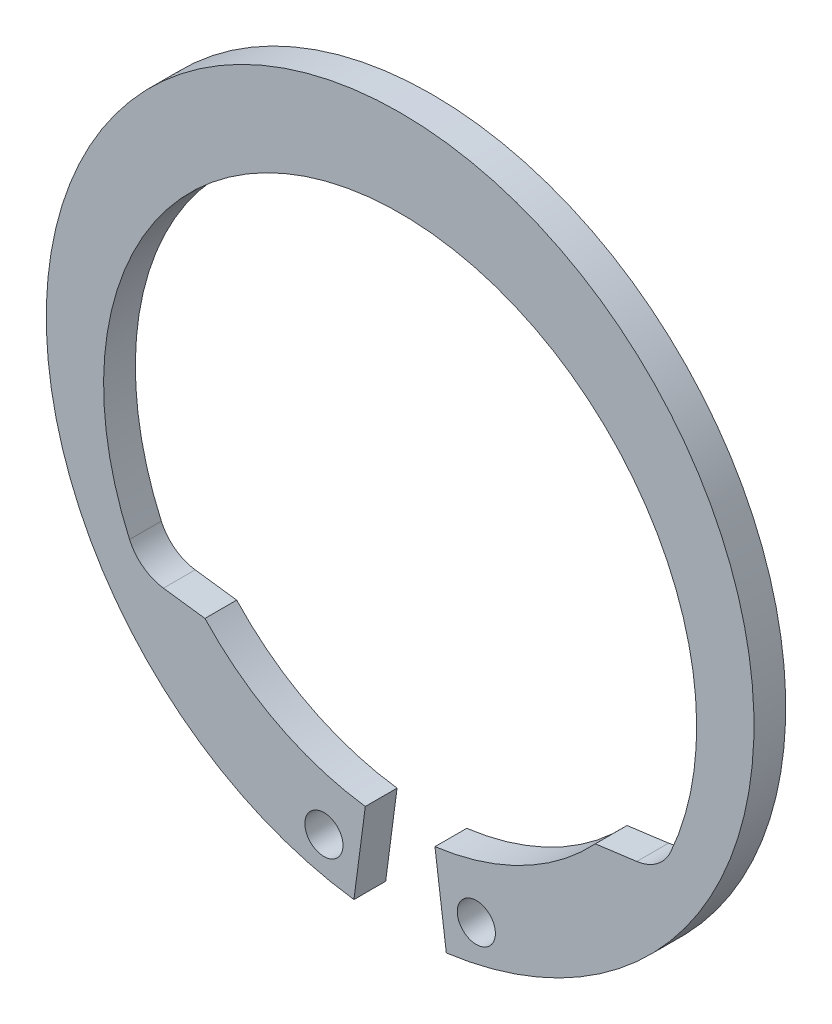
ISO-10303-21;
HEADER;
FILE_DESCRIPTION(('STEP AP214'),'2;1');
FILE_NAME('part.step','',(''),(''),'','','');
FILE_SCHEMA(('AUTOMOTIVE_DESIGN { 1 0 10303 214 1 1 1 1 }'));
ENDSEC;
DATA;
#1=APPLICATION_CONTEXT('core data for automotive mechanical design processes');
#2=APPLICATION_PROTOCOL_DEFINITION('international standard','automotive_design',2000,#1);
#3=PRODUCT_CONTEXT('',#1,'mechanical');
#4=PRODUCT('Part','Part','',(#3));
#5=PRODUCT_RELATED_PRODUCT_CATEGORY('part','',(#4));
#6=PRODUCT_DEFINITION_FORMATION('','',#4);
#7=PRODUCT_DEFINITION_CONTEXT('part definition',#1,'design');
#8=PRODUCT_DEFINITION('design','',#6,#7);
#9=PRODUCT_DEFINITION_SHAPE('','',#8);
#10=(LENGTH_UNIT() NAMED_UNIT(*) SI_UNIT(.MILLI.,.METRE.));
#11=(NAMED_UNIT(*) PLANE_ANGLE_UNIT() SI_UNIT($,.RADIAN.));
#12=(NAMED_UNIT(*) SI_UNIT($,.STERADIAN.) SOLID_ANGLE_UNIT());
#13=UNCERTAINTY_MEASURE_WITH_UNIT(LENGTH_MEASURE(1.E-05),#10,'distance_accuracy_value','');
#14=(GEOMETRIC_REPRESENTATION_CONTEXT(3) GLOBAL_UNCERTAINTY_ASSIGNED_CONTEXT((#13)) GLOBAL_UNIT_ASSIGNED_CONTEXT((#10,
#11,#12)) REPRESENTATION_CONTEXT('',''));
#15=CARTESIAN_POINT('',(0.,0.,0.));
#16=DIRECTION('',(0.,0.,1.));
#17=DIRECTION('',(1.,0.,0.));
#18=AXIS2_PLACEMENT_3D('',#15,#16,#17);
#19=CARTESIAN_POINT('',(0.,0.,-0.889));
#20=DIRECTION('',(0.,0.,1.));
#21=DIRECTION('',(1.,0.,0.));
#22=AXIS2_PLACEMENT_3D('',#19,#20,#21);
#23=CYLINDRICAL_SURFACE('',#22,9.906);
#24=CARTESIAN_POINT('',(0.,0.,0.));
#25=DIRECTION('',(0.,0.,1.));
#26=DIRECTION('',(1.,0.,0.));
#27=AXIS2_PLACEMENT_3D('',#24,#25,#26);
#28=CIRCLE('',#27,9.906);
#29=CARTESIAN_POINT('',(1.29299246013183,-9.82125279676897,0.));
#30=VERTEX_POINT('',#29);
#31=CARTESIAN_POINT('',(-1.29299246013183,-9.82125279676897,0.));
#32=VERTEX_POINT('',#31);
#33=EDGE_CURVE('E142',#30,#32,#28,.T.);
#34=ORIENTED_EDGE('',*,*,#33,.F.);
#35=DIRECTION('',(0.,0.,1.));
#36=VECTOR('',#35,1.);
#37=CARTESIAN_POINT('',(1.29299246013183,-9.82125279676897,-0.889));
#38=LINE('',#37,#36);
#39=CARTESIAN_POINT('',(1.29299246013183,-9.82125279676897,-0.889));
#40=VERTEX_POINT('',#39);
#41=EDGE_CURVE('E11',#40,#30,#38,.T.);
#42=ORIENTED_EDGE('',*,*,#41,.F.);
#43=CARTESIAN_POINT('',(0.,0.,-0.889));
#44=DIRECTION('',(0.,0.,1.));
#45=DIRECTION('',(1.,0.,0.));
#46=AXIS2_PLACEMENT_3D('',#43,#44,#45);
#47=CIRCLE('',#46,9.906);
#48=CARTESIAN_POINT('',(-1.29299246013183,-9.82125279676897,-0.889));
#49=VERTEX_POINT('',#48);
#50=EDGE_CURVE('E169',#40,#49,#47,.T.);
#51=ORIENTED_EDGE('',*,*,#50,.T.);
#52=DIRECTION('',(0.,0.,1.));
#53=VECTOR('',#52,1.);
#54=CARTESIAN_POINT('',(-1.29299246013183,-9.82125279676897,-0.889));
#55=LINE('',#54,#53);
#56=EDGE_CURVE('E36',#49,#32,#55,.T.);
#57=ORIENTED_EDGE('',*,*,#56,.T.);
#58=EDGE_LOOP('',(#34,#42,#51,#57));
#59=FACE_BOUND('',#58,.T.);
#60=ADVANCED_FACE('F33',(#59),#23,.T.);
#61=CARTESIAN_POINT('',(0.974717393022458,-7.40371364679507,-0.889));
#62=DIRECTION('',(-0.99144486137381,-0.130526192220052,0.));
#63=DIRECTION('',(0.130526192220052,-0.99144486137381,0.));
#64=AXIS2_PLACEMENT_3D('',#61,#62,#63);
#65=PLANE('',#64);
#66=DIRECTION('',(0.130526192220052,-0.99144486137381,0.));
#67=VECTOR('',#66,1.);
#68=CARTESIAN_POINT('',(0.974717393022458,-7.40371364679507,0.));
#69=LINE('',#68,#67);
#70=CARTESIAN_POINT('',(0.974717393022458,-7.40371364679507,0.));
#71=VERTEX_POINT('',#70);
#72=EDGE_CURVE('E167',#71,#30,#69,.T.);
#73=ORIENTED_EDGE('',*,*,#72,.F.);
#74=DIRECTION('',(0.,0.,1.));
#75=VECTOR('',#74,1.);
#76=CARTESIAN_POINT('',(0.974717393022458,-7.40371364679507,-0.889));
#77=LINE('',#76,#75);
#78=CARTESIAN_POINT('',(0.974717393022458,-7.40371364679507,-0.889));
#79=VERTEX_POINT('',#78);
#80=EDGE_CURVE('E42',#79,#71,#77,.T.);
#81=ORIENTED_EDGE('',*,*,#80,.F.);
#82=DIRECTION('',(0.130526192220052,-0.99144486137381,0.));
#83=VECTOR('',#82,1.);
#84=CARTESIAN_POINT('',(0.974717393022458,-7.40371364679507,-0.889));
#85=LINE('',#84,#83);
#86=EDGE_CURVE('E132',#79,#40,#85,.T.);
#87=ORIENTED_EDGE('',*,*,#86,.T.);
#88=ORIENTED_EDGE('',*,*,#41,.T.);
#89=EDGE_LOOP('',(#73,#81,#87,#88));
#90=FACE_BOUND('',#89,.T.);
#91=ADVANCED_FACE('F185',(#90),#65,.T.);
#92=CARTESIAN_POINT('',(0.,0.,-0.889));
#93=DIRECTION('',(0.,0.,1.));
#94=DIRECTION('',(1.,0.,0.));
#95=AXIS2_PLACEMENT_3D('',#92,#93,#94);
#96=CYLINDRICAL_SURFACE('',#95,7.4676);
#97=CARTESIAN_POINT('',(0.,0.,0.));
#98=DIRECTION('',(0.,0.,-1.));
#99=DIRECTION('',(1.,0.,0.));
#100=AXIS2_PLACEMENT_3D('',#97,#98,#99);
#101=CIRCLE('',#100,7.4676);
#102=CARTESIAN_POINT('',(5.46404070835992,-5.09011875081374,0.));
#103=VERTEX_POINT('',#102);
#104=EDGE_CURVE('E119',#103,#71,#101,.T.);
#105=ORIENTED_EDGE('',*,*,#104,.F.);
#106=DIRECTION('',(0.,0.,1.));
#107=VECTOR('',#106,1.);
#108=CARTESIAN_POINT('',(5.46404070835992,-5.09011875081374,-0.889));
#109=LINE('',#108,#107);
#110=CARTESIAN_POINT('',(5.46404070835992,-5.09011875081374,-0.889));
#111=VERTEX_POINT('',#110);
#112=EDGE_CURVE('E114',#111,#103,#109,.T.);
#113=ORIENTED_EDGE('',*,*,#112,.F.);
#114=CARTESIAN_POINT('',(0.,0.,-0.889));
#115=DIRECTION('',(0.,0.,-1.));
#116=DIRECTION('',(1.,0.,0.));
#117=AXIS2_PLACEMENT_3D('',#114,#115,#116);
#118=CIRCLE('',#117,7.4676);
#119=EDGE_CURVE('E117',#111,#79,#118,.T.);
#120=ORIENTED_EDGE('',*,*,#119,.T.);
#121=ORIENTED_EDGE('',*,*,#80,.T.);
#122=EDGE_LOOP('',(#105,#113,#120,#121));
#123=FACE_BOUND('',#122,.T.);
#124=ADVANCED_FACE('F116',(#123),#96,.F.);
#125=CARTESIAN_POINT('',(6.62556212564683,-4.93720155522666,-0.889));
#126=DIRECTION('',(-0.130526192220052,0.99144486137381,0.));
#127=DIRECTION('',(-0.99144486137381,-0.130526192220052,0.));
#128=AXIS2_PLACEMENT_3D('',#125,#126,#127);
#129=PLANE('',#128);
#130=DIRECTION('',(-0.99144486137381,-0.130526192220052,0.));
#131=VECTOR('',#130,1.);
#132=CARTESIAN_POINT('',(6.62556212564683,-4.93720155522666,0.));
#133=LINE('',#132,#131);
#134=CARTESIAN_POINT('',(6.62556212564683,-4.93720155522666,0.));
#135=VERTEX_POINT('',#134);
#136=EDGE_CURVE('E164',#135,#103,#133,.T.);
#137=ORIENTED_EDGE('',*,*,#136,.F.);
#138=DIRECTION('',(0.,0.,1.));
#139=VECTOR('',#138,1.);
#140=CARTESIAN_POINT('',(6.62556212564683,-4.93720155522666,-0.889));
#141=LINE('',#140,#139);
#142=CARTESIAN_POINT('',(6.62556212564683,-4.93720155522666,-0.889));
#143=VERTEX_POINT('',#142);
#144=EDGE_CURVE('E124',#143,#135,#141,.T.);
#145=ORIENTED_EDGE('',*,*,#144,.F.);
#146=DIRECTION('',(-0.99144486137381,-0.130526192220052,0.));
#147=VECTOR('',#146,1.);
#148=CARTESIAN_POINT('',(6.62556212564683,-4.93720155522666,-0.889));
#149=LINE('',#148,#147);
#150=EDGE_CURVE('E130',#143,#111,#149,.T.);
#151=ORIENTED_EDGE('',*,*,#150,.T.);
#152=ORIENTED_EDGE('',*,*,#112,.T.);
#153=EDGE_LOOP('',(#137,#145,#151,#152));
#154=FACE_BOUND('',#153,.T.);
#155=ADVANCED_FACE('F134',(#154),#129,.T.);
#156=CARTESIAN_POINT('',(6.46713130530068,-3.73379999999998,-0.889));
#157=DIRECTION('',(0.,0.,1.));
#158=DIRECTION('',(1.,0.,0.));
#159=AXIS2_PLACEMENT_3D('',#156,#157,#158);
#160=CYLINDRICAL_SURFACE('',#159,1.21378565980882);
#161=CARTESIAN_POINT('',(6.46713130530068,-3.73379999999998,0.));
#162=DIRECTION('',(0.,0.,-1.));
#163=DIRECTION('',(1.,0.,0.));
#164=AXIS2_PLACEMENT_3D('',#161,#162,#163);
#165=CIRCLE('',#164,1.21378565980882);
#166=CARTESIAN_POINT('',(7.57466030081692,-4.23044388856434,0.));
#167=VERTEX_POINT('',#166);
#168=EDGE_CURVE('E161',#167,#135,#165,.T.);
#169=ORIENTED_EDGE('',*,*,#168,.F.);
#170=DIRECTION('',(0.,0.,1.));
#171=VECTOR('',#170,1.);
#172=CARTESIAN_POINT('',(7.57466030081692,-4.23044388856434,-0.889));
#173=LINE('',#172,#171);
#174=CARTESIAN_POINT('',(7.57466030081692,-4.23044388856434,-0.889));
#175=VERTEX_POINT('',#174);
#176=EDGE_CURVE('E173',#175,#167,#173,.T.);
#177=ORIENTED_EDGE('',*,*,#176,.F.);
#178=CARTESIAN_POINT('',(6.46713130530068,-3.73379999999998,-0.889));
#179=DIRECTION('',(0.,0.,-1.));
#180=DIRECTION('',(1.,0.,0.));
#181=AXIS2_PLACEMENT_3D('',#178,#179,#180);
#182=CIRCLE('',#181,1.21378565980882);
#183=EDGE_CURVE('E135',#175,#143,#182,.T.);
#184=ORIENTED_EDGE('',*,*,#183,.T.);
#185=ORIENTED_EDGE('',*,*,#144,.T.);
#186=EDGE_LOOP('',(#169,#177,#184,#185));
#187=FACE_BOUND('',#186,.T.);
#188=ADVANCED_FACE('F198',(#187),#160,.F.);
#189=CARTESIAN_POINT('',(0.,-0.833775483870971,-0.889));
#190=DIRECTION('',(0.,0.,1.));
#191=DIRECTION('',(1.,0.,0.));
#192=AXIS2_PLACEMENT_3D('',#189,#190,#191);
#193=CYLINDRICAL_SURFACE('',#192,8.30137548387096);
#194=CARTESIAN_POINT('',(0.,-0.833775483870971,0.));
#195=DIRECTION('',(0.,0.,-1.));
#196=DIRECTION('',(1.,0.,0.));
#197=AXIS2_PLACEMENT_3D('',#194,#195,#196);
#198=CIRCLE('',#197,8.30137548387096);
#199=CARTESIAN_POINT('',(-7.57466030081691,-4.23044388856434,0.));
#200=VERTEX_POINT('',#199);
#201=EDGE_CURVE('E158',#200,#167,#198,.T.);
#202=ORIENTED_EDGE('',*,*,#201,.F.);
#203=DIRECTION('',(0.,0.,1.));
#204=VECTOR('',#203,1.);
#205=CARTESIAN_POINT('',(-7.57466030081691,-4.23044388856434,-0.889));
#206=LINE('',#205,#204);
#207=CARTESIAN_POINT('',(-7.57466030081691,-4.23044388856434,-0.889));
#208=VERTEX_POINT('',#207);
#209=EDGE_CURVE('E175',#208,#200,#206,.T.);
#210=ORIENTED_EDGE('',*,*,#209,.F.);
#211=CARTESIAN_POINT('',(0.,-0.833775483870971,-0.889));
#212=DIRECTION('',(0.,0.,-1.));
#213=DIRECTION('',(1.,0.,0.));
#214=AXIS2_PLACEMENT_3D('',#211,#212,#213);
#215=CIRCLE('',#214,8.30137548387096);
#216=EDGE_CURVE('E137',#208,#175,#215,.T.);
#217=ORIENTED_EDGE('',*,*,#216,.T.);
#218=ORIENTED_EDGE('',*,*,#176,.T.);
#219=EDGE_LOOP('',(#202,#210,#217,#218));
#220=FACE_BOUND('',#219,.T.);
#221=ADVANCED_FACE('F201',(#220),#193,.F.);
#222=CARTESIAN_POINT('',(-6.46713130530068,-3.73379999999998,-0.889));
#223=DIRECTION('',(0.,0.,1.));
#224=DIRECTION('',(1.,0.,0.));
#225=AXIS2_PLACEMENT_3D('',#222,#223,#224);
#226=CYLINDRICAL_SURFACE('',#225,1.21378565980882);
#227=CARTESIAN_POINT('',(-6.46713130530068,-3.73379999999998,0.));
#228=DIRECTION('',(0.,0.,-1.));
#229=DIRECTION('',(1.,0.,0.));
#230=AXIS2_PLACEMENT_3D('',#227,#228,#229);
#231=CIRCLE('',#230,1.21378565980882);
#232=CARTESIAN_POINT('',(-6.62556212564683,-4.93720155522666,0.));
#233=VERTEX_POINT('',#232);
#234=EDGE_CURVE('E155',#233,#200,#231,.T.);
#235=ORIENTED_EDGE('',*,*,#234,.F.);
#236=DIRECTION('',(0.,0.,1.));
#237=VECTOR('',#236,1.);
#238=CARTESIAN_POINT('',(-6.62556212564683,-4.93720155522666,-0.889));
#239=LINE('',#238,#237);
#240=CARTESIAN_POINT('',(-6.62556212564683,-4.93720155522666,-0.889));
#241=VERTEX_POINT('',#240);
#242=EDGE_CURVE('E177',#241,#233,#239,.T.);
#243=ORIENTED_EDGE('',*,*,#242,.F.);
#244=CARTESIAN_POINT('',(-6.46713130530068,-3.73379999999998,-0.889));
#245=DIRECTION('',(0.,0.,-1.));
#246=DIRECTION('',(1.,0.,0.));
#247=AXIS2_PLACEMENT_3D('',#244,#245,#246);
#248=CIRCLE('',#247,1.21378565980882);
#249=EDGE_CURVE('E261',#241,#208,#248,.T.);
#250=ORIENTED_EDGE('',*,*,#249,.T.);
#251=ORIENTED_EDGE('',*,*,#209,.T.);
#252=EDGE_LOOP('',(#235,#243,#250,#251));
#253=FACE_BOUND('',#252,.T.);
#254=ADVANCED_FACE('F205',(#253),#226,.F.);
#255=CARTESIAN_POINT('',(-6.62556212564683,-4.93720155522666,-0.889));
#256=DIRECTION('',(0.130526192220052,0.99144486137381,0.));
#257=DIRECTION('',(-0.99144486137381,0.130526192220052,0.));
#258=AXIS2_PLACEMENT_3D('',#255,#256,#257);
#259=PLANE('',#258);
#260=DIRECTION('',(-0.99144486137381,0.130526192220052,0.));
#261=VECTOR('',#260,1.);
#262=CARTESIAN_POINT('',(-6.62556212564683,-4.93720155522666,0.));
#263=LINE('',#262,#261);
#264=CARTESIAN_POINT('',(-5.46404070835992,-5.09011875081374,0.));
#265=VERTEX_POINT('',#264);
#266=EDGE_CURVE('E152',#265,#233,#263,.T.);
#267=ORIENTED_EDGE('',*,*,#266,.F.);
#268=DIRECTION('',(0.,0.,1.));
#269=VECTOR('',#268,1.);
#270=CARTESIAN_POINT('',(-5.46404070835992,-5.09011875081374,-0.889));
#271=LINE('',#270,#269);
#272=CARTESIAN_POINT('',(-5.46404070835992,-5.09011875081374,-0.889));
#273=VERTEX_POINT('',#272);
#274=EDGE_CURVE('E179',#273,#265,#271,.T.);
#275=ORIENTED_EDGE('',*,*,#274,.F.);
#276=DIRECTION('',(-0.99144486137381,0.130526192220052,0.));
#277=VECTOR('',#276,1.);
#278=CARTESIAN_POINT('',(-6.62556212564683,-4.93720155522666,-0.889));
#279=LINE('',#278,#277);
#280=EDGE_CURVE('E258',#273,#241,#279,.T.);
#281=ORIENTED_EDGE('',*,*,#280,.T.);
#282=ORIENTED_EDGE('',*,*,#242,.T.);
#283=EDGE_LOOP('',(#267,#275,#281,#282));
#284=FACE_BOUND('',#283,.T.);
#285=ADVANCED_FACE('F209',(#284),#259,.T.);
#286=CARTESIAN_POINT('',(0.,0.,-0.889));
#287=DIRECTION('',(0.,0.,1.));
#288=DIRECTION('',(1.,0.,0.));
#289=AXIS2_PLACEMENT_3D('',#286,#287,#288);
#290=CYLINDRICAL_SURFACE('',#289,7.4676);
#291=CARTESIAN_POINT('',(0.,0.,0.));
#292=DIRECTION('',(0.,0.,-1.));
#293=DIRECTION('',(1.,0.,0.));
#294=AXIS2_PLACEMENT_3D('',#291,#292,#293);
#295=CIRCLE('',#294,7.4676);
#296=CARTESIAN_POINT('',(-0.974717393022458,-7.40371364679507,0.));
#297=VERTEX_POINT('',#296);
#298=EDGE_CURVE('E149',#297,#265,#295,.T.);
#299=ORIENTED_EDGE('',*,*,#298,.F.);
#300=DIRECTION('',(0.,0.,1.));
#301=VECTOR('',#300,1.);
#302=CARTESIAN_POINT('',(-0.974717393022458,-7.40371364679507,-0.889));
#303=LINE('',#302,#301);
#304=CARTESIAN_POINT('',(-0.974717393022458,-7.40371364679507,-0.889));
#305=VERTEX_POINT('',#304);
#306=EDGE_CURVE('E180',#305,#297,#303,.T.);
#307=ORIENTED_EDGE('',*,*,#306,.F.);
#308=CARTESIAN_POINT('',(0.,0.,-0.889));
#309=DIRECTION('',(0.,0.,-1.));
#310=DIRECTION('',(1.,0.,0.));
#311=AXIS2_PLACEMENT_3D('',#308,#309,#310);
#312=CIRCLE('',#311,7.4676);
#313=EDGE_CURVE('E255',#305,#273,#312,.T.);
#314=ORIENTED_EDGE('',*,*,#313,.T.);
#315=ORIENTED_EDGE('',*,*,#274,.T.);
#316=EDGE_LOOP('',(#299,#307,#314,#315));
#317=FACE_BOUND('',#316,.T.);
#318=ADVANCED_FACE('F213',(#317),#290,.F.);
#319=CARTESIAN_POINT('',(-0.974717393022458,-7.40371364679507,-0.889));
#320=DIRECTION('',(0.99144486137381,-0.130526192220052,0.));
#321=DIRECTION('',(0.130526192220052,0.99144486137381,0.));
#322=AXIS2_PLACEMENT_3D('',#319,#320,#321);
#323=PLANE('',#322);
#324=DIRECTION('',(0.130526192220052,0.99144486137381,0.));
#325=VECTOR('',#324,1.);
#326=CARTESIAN_POINT('',(-0.974717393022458,-7.40371364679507,0.));
#327=LINE('',#326,#325);
#328=EDGE_CURVE('E145',#32,#297,#327,.T.);
#329=ORIENTED_EDGE('',*,*,#328,.F.);
#330=ORIENTED_EDGE('',*,*,#56,.F.);
#331=DIRECTION('',(0.130526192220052,0.99144486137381,0.));
#332=VECTOR('',#331,1.);
#333=CARTESIAN_POINT('',(-0.974717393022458,-7.40371364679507,-0.889));
#334=LINE('',#333,#332);
#335=EDGE_CURVE('E253',#49,#305,#334,.T.);
#336=ORIENTED_EDGE('',*,*,#335,.T.);
#337=ORIENTED_EDGE('',*,*,#306,.T.);
#338=EDGE_LOOP('',(#329,#330,#336,#337));
#339=FACE_BOUND('',#338,.T.);
#340=ADVANCED_FACE('F182',(#339),#323,.T.);
#341=CARTESIAN_POINT('',(0.,0.,-0.889));
#342=DIRECTION('',(0.,0.,1.));
#343=DIRECTION('',(1.,0.,0.));
#344=AXIS2_PLACEMENT_3D('',#341,#342,#343);
#345=PLANE('',#344);
#346=CARTESIAN_POINT('',(-2.13324352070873,-8.66296110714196,-0.889));
#347=DIRECTION('',(0.,0.,1.));
#348=DIRECTION('',(1.,0.,0.));
#349=AXIS2_PLACEMENT_3D('',#346,#347,#348);
#350=CIRCLE('',#349,0.5334);
#351=CARTESIAN_POINT('',(-1.59984352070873,-8.66296110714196,-0.889));
#352=VERTEX_POINT('',#351);
#353=EDGE_CURVE('E240',#352,#352,#350,.T.);
#354=ORIENTED_EDGE('',*,*,#353,.T.);
#355=EDGE_LOOP('',(#354));
#356=FACE_BOUND('',#355,.T.);
#357=CARTESIAN_POINT('',(2.13324352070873,-8.66296110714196,-0.889));
#358=DIRECTION('',(0.,0.,1.));
#359=DIRECTION('',(1.,0.,0.));
#360=AXIS2_PLACEMENT_3D('',#357,#358,#359);
#361=CIRCLE('',#360,0.5334);
#362=CARTESIAN_POINT('',(2.66664352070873,-8.66296110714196,-0.889));
#363=VERTEX_POINT('',#362);
#364=EDGE_CURVE('E146',#363,#363,#361,.T.);
#365=ORIENTED_EDGE('',*,*,#364,.T.);
#366=EDGE_LOOP('',(#365));
#367=FACE_BOUND('',#366,.T.);
#368=ORIENTED_EDGE('',*,*,#50,.F.);
#369=ORIENTED_EDGE('',*,*,#86,.F.);
#370=ORIENTED_EDGE('',*,*,#119,.F.);
#371=ORIENTED_EDGE('',*,*,#150,.F.);
#372=ORIENTED_EDGE('',*,*,#183,.F.);
#373=ORIENTED_EDGE('',*,*,#216,.F.);
#374=ORIENTED_EDGE('',*,*,#249,.F.);
#375=ORIENTED_EDGE('',*,*,#280,.F.);
#376=ORIENTED_EDGE('',*,*,#313,.F.);
#377=ORIENTED_EDGE('',*,*,#335,.F.);
#378=EDGE_LOOP('',(#368,#369,#370,#371,#372,#373,#374,#375,#376,#377));
#379=FACE_BOUND('',#378,.T.);
#380=ADVANCED_FACE('F128',(#356,#367,#379),#345,.F.);
#381=CARTESIAN_POINT('',(0.,0.,0.));
#382=DIRECTION('',(0.,0.,1.));
#383=DIRECTION('',(1.,0.,0.));
#384=AXIS2_PLACEMENT_3D('',#381,#382,#383);
#385=PLANE('',#384);
#386=CARTESIAN_POINT('',(-2.13324352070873,-8.66296110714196,0.));
#387=DIRECTION('',(0.,0.,1.));
#388=DIRECTION('',(1.,0.,0.));
#389=AXIS2_PLACEMENT_3D('',#386,#387,#388);
#390=CIRCLE('',#389,0.5334);
#391=CARTESIAN_POINT('',(-1.59984352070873,-8.66296110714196,0.));
#392=VERTEX_POINT('',#391);
#393=EDGE_CURVE('E243',#392,#392,#390,.T.);
#394=ORIENTED_EDGE('',*,*,#393,.F.);
#395=EDGE_LOOP('',(#394));
#396=FACE_BOUND('',#395,.T.);
#397=CARTESIAN_POINT('',(2.13324352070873,-8.66296110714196,0.));
#398=DIRECTION('',(0.,0.,1.));
#399=DIRECTION('',(1.,0.,0.));
#400=AXIS2_PLACEMENT_3D('',#397,#398,#399);
#401=CIRCLE('',#400,0.5334);
#402=CARTESIAN_POINT('',(2.66664352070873,-8.66296110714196,0.));
#403=VERTEX_POINT('',#402);
#404=EDGE_CURVE('E245',#403,#403,#401,.T.);
#405=ORIENTED_EDGE('',*,*,#404,.F.);
#406=EDGE_LOOP('',(#405));
#407=FACE_BOUND('',#406,.T.);
#408=ORIENTED_EDGE('',*,*,#33,.T.);
#409=ORIENTED_EDGE('',*,*,#328,.T.);
#410=ORIENTED_EDGE('',*,*,#298,.T.);
#411=ORIENTED_EDGE('',*,*,#266,.T.);
#412=ORIENTED_EDGE('',*,*,#234,.T.);
#413=ORIENTED_EDGE('',*,*,#201,.T.);
#414=ORIENTED_EDGE('',*,*,#168,.T.);
#415=ORIENTED_EDGE('',*,*,#136,.T.);
#416=ORIENTED_EDGE('',*,*,#104,.T.);
#417=ORIENTED_EDGE('',*,*,#72,.T.);
#418=EDGE_LOOP('',(#408,#409,#410,#411,#412,#413,#414,#415,#416,#417));
#419=FACE_BOUND('',#418,.T.);
#420=ADVANCED_FACE('F184',(#396,#407,#419),#385,.T.);
#421=CARTESIAN_POINT('',(2.13324352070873,-8.66296110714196,-0.889));
#422=DIRECTION('',(0.,0.,1.));
#423=DIRECTION('',(1.,0.,0.));
#424=AXIS2_PLACEMENT_3D('',#421,#422,#423);
#425=CYLINDRICAL_SURFACE('',#424,0.5334);
#426=ORIENTED_EDGE('',*,*,#364,.F.);
#427=EDGE_LOOP('',(#426));
#428=FACE_BOUND('',#427,.T.);
#429=ORIENTED_EDGE('',*,*,#404,.T.);
#430=EDGE_LOOP('',(#429));
#431=FACE_BOUND('',#430,.T.);
#432=ADVANCED_FACE('F225',(#428,#431),#425,.F.);
#433=CARTESIAN_POINT('',(-2.13324352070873,-8.66296110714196,-0.889));
#434=DIRECTION('',(0.,0.,1.));
#435=DIRECTION('',(1.,0.,0.));
#436=AXIS2_PLACEMENT_3D('',#433,#434,#435);
#437=CYLINDRICAL_SURFACE('',#436,0.5334);
#438=ORIENTED_EDGE('',*,*,#353,.F.);
#439=EDGE_LOOP('',(#438));
#440=FACE_BOUND('',#439,.T.);
#441=ORIENTED_EDGE('',*,*,#393,.T.);
#442=EDGE_LOOP('',(#441));
#443=FACE_BOUND('',#442,.T.);
#444=ADVANCED_FACE('F232',(#440,#443),#437,.F.);
#445=CLOSED_SHELL('',(#60,#91,#124,#155,#188,#221,#254,#285,#318,#340,#380,#420,#432,#444));
#446=MANIFOLD_SOLID_BREP('B2',#445);
#447=ADVANCED_BREP_SHAPE_REPRESENTATION('',(#18,#446),#14);
#448=SHAPE_DEFINITION_REPRESENTATION(#9,#447);
ENDSEC;
END-ISO-10303-21;
